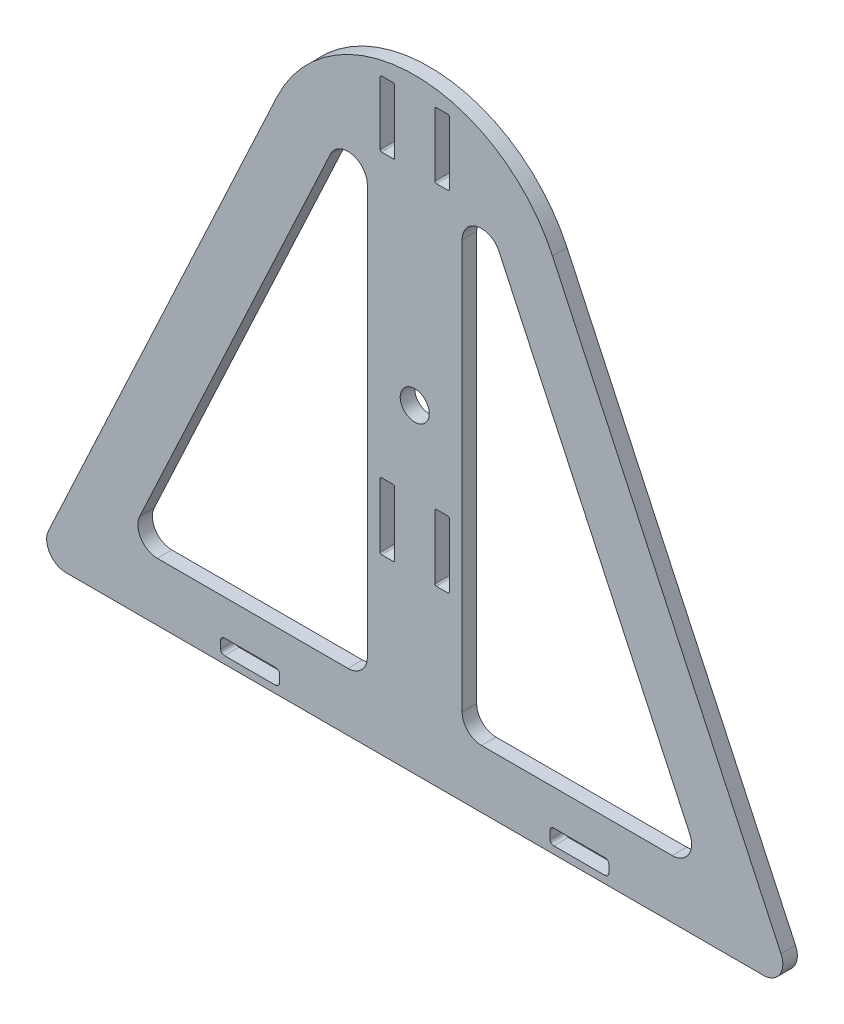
from build123d import *

# Parameters (mm, degrees)
EXTRUDE1_DEPTH     = 4.7625
SKETCH2_R          = 4.7625
CUT_EXTRUDE1_DEPTH = 231.102586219
CUT_EXTRUDE2_DEPTH = 231.102586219


with BuildPart() as part:
    # Sketch1 → Extrude1 (new body)
    with BuildSketch(Plane.XY):
        with BuildLine():
            Line((-120.055054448, 6.493625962), (-45.159285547, 167.108120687))
            ThreePointArc((-45.159285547, 167.108120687), (0, 195.877758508), (45.159285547, 167.108120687))
            Line((45.159285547, 167.108120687), (120.055054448, 6.493625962))
            ThreePointArc((120.055054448, 6.493625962), (119.655535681, 0.398147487), (114.3, -2.54))
            Line((114.3, -2.54), (30.236227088, -2.54))
            Line((30.236227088, -2.54), (-30.236227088, -2.54))
            Line((-30.236227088, -2.54), (-114.3, -2.54))
            ThreePointArc((-114.3, -2.54), (-119.655535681, 0.398147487), (-120.055054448, 6.493625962))
        make_face()
        with BuildLine():
            Line((-10.838206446, 190.1825), (-7.091706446, 190.1825))
            ThreePointArc((-7.091706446, 190.1825), (-6.732496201, 190.033710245), (-6.583706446, 189.6745))
            Line((-6.583706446, 189.6745), (-6.583706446, 169.1005))
            ThreePointArc((-6.583706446, 169.1005), (-6.732496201, 168.741289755), (-7.091706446, 168.5925))
            Line((-7.091706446, 168.5925), (-10.838206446, 168.5925))
            ThreePointArc((-10.838206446, 168.5925), (-11.19741669, 168.741289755), (-11.346206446, 169.1005))
            Line((-11.346206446, 169.1005), (-11.346206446, 189.6745))
            ThreePointArc((-11.346206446, 189.6745), (-11.19741669, 190.033710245), (-10.838206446, 190.1825))
        make_face(mode=Mode.SUBTRACT)
        with BuildLine():
            Line((6.583706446, 169.1005), (6.583706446, 189.6745))
            ThreePointArc((6.583706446, 189.6745), (6.732496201, 190.033710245), (7.091706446, 190.1825))
            Line((7.091706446, 190.1825), (10.838206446, 190.1825))
            ThreePointArc((10.838206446, 190.1825), (11.19741669, 190.033710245), (11.346206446, 189.6745))
            Line((11.346206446, 189.6745), (11.346206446, 169.1005))
            ThreePointArc((11.346206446, 169.1005), (11.19741669, 168.741289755), (10.838206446, 168.5925))
            Line((10.838206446, 168.5925), (7.091706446, 168.5925))
            ThreePointArc((7.091706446, 168.5925), (6.732496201, 168.741289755), (6.583706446, 169.1005))
        make_face(mode=Mode.SUBTRACT)
        with BuildLine():
            Line((7.091706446, 76.1365), (10.838206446, 76.1365))
            ThreePointArc((10.838206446, 76.1365), (11.19741669, 75.987710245), (11.346206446, 75.6285))
            Line((11.346206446, 75.6285), (11.346206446, 54.8005))
            ThreePointArc((11.346206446, 54.8005), (11.19741669, 54.441289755), (10.838206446, 54.2925))
            Line((10.838206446, 54.2925), (7.091706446, 54.2925))
            ThreePointArc((7.091706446, 54.2925), (6.732496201, 54.441289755), (6.583706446, 54.8005))
            Line((6.583706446, 54.8005), (6.583706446, 75.6285))
            ThreePointArc((6.583706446, 75.6285), (6.732496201, 75.987710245), (7.091706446, 76.1365))
        make_face(mode=Mode.SUBTRACT)
        with BuildLine():
            Line((63.627, 3.6195), (63.627, 1.143))
            ThreePointArc((63.627, 1.143), (63.255025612, 0.244974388), (62.357, -0.127))
            Line((62.357, -0.127), (45.593, -0.127))
            ThreePointArc((45.593, -0.127), (44.694974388, 0.244974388), (44.323, 1.143))
            Line((44.323, 1.143), (44.323, 3.6195))
            ThreePointArc((44.323, 3.6195), (44.694974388, 4.517525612), (45.593, 4.8895))
            Line((45.593, 4.8895), (62.357, 4.8895))
            ThreePointArc((62.357, 4.8895), (63.255025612, 4.517525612), (63.627, 3.6195))
        make_face(mode=Mode.SUBTRACT)
        with BuildLine():
            Line((-62.357, -0.127), (-45.593, -0.127))
            ThreePointArc((-45.593, -0.127), (-44.694974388, 0.244974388), (-44.323, 1.143))
            Line((-44.323, 1.143), (-44.323, 3.6195))
            ThreePointArc((-44.323, 3.6195), (-44.694974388, 4.517525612), (-45.593, 4.8895))
            Line((-45.593, 4.8895), (-62.357, 4.8895))
            ThreePointArc((-62.357, 4.8895), (-63.255025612, 4.517525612), (-63.627, 3.6195))
            Line((-63.627, 3.6195), (-63.627, 1.143))
            ThreePointArc((-63.627, 1.143), (-63.255025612, 0.244974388), (-62.357, -0.127))
        make_face(mode=Mode.SUBTRACT)
        with BuildLine():
            Line((-11.346206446, 75.6285), (-11.346206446, 54.8005))
            ThreePointArc((-11.346206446, 54.8005), (-11.19741669, 54.441289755), (-10.838206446, 54.2925))
            Line((-10.838206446, 54.2925), (-7.091706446, 54.2925))
            ThreePointArc((-7.091706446, 54.2925), (-6.732496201, 54.441289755), (-6.583706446, 54.8005))
            Line((-6.583706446, 54.8005), (-6.583706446, 75.6285))
            ThreePointArc((-6.583706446, 75.6285), (-6.732496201, 75.987710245), (-7.091706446, 76.1365))
            Line((-7.091706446, 76.1365), (-10.838206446, 76.1365))
            ThreePointArc((-10.838206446, 76.1365), (-11.19741669, 75.987710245), (-11.346206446, 75.6285))
        make_face(mode=Mode.SUBTRACT)
    extrude(amount=EXTRUDE1_DEPTH)

    # Sketch2 → Cut-Extrude1 (cut, through all)
    with BuildSketch(Plane.XY.offset(4.7625)):
        with Locations((0, 102.108)):
            Circle(SKETCH2_R)
    extrude(amount=-CUT_EXTRUDE1_DEPTH, mode=Mode.SUBTRACT)

    # Sketch3 → Cut-Extrude2 (cut, through all)
    with BuildSketch(Plane.XY.offset(4.7625)):
        with BuildLine():
            Line((84.397489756, 16.51), (21.887206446, 16.51))
            ThreePointArc((21.887206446, 16.51), (17.397078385, 18.369871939), (15.537206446, 22.86))
            Line((15.537206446, 22.86), (15.537206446, 156.913735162))
            ThreePointArc((15.537206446, 156.913735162), (20.512814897, 163.113214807), (27.642260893, 159.597361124))
            Line((27.642260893, 159.597361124), (90.152544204, 25.543625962))
            ThreePointArc((90.152544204, 25.543625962), (89.753025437, 19.448147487), (84.397489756, 16.51))
        make_face()
        with BuildLine():
            Line((-27.642260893, 159.597361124), (-90.152544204, 25.543625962))
            ThreePointArc((-90.152544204, 25.543625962), (-89.753025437, 19.448147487), (-84.397489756, 16.51))
            Line((-84.397489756, 16.51), (-21.887206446, 16.51))
            ThreePointArc((-21.887206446, 16.51), (-17.397078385, 18.369871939), (-15.537206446, 22.86))
            Line((-15.537206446, 22.86), (-15.537206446, 156.913735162))
            ThreePointArc((-15.537206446, 156.913735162), (-20.512814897, 163.113214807), (-27.642260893, 159.597361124))
        make_face()
    extrude(amount=-CUT_EXTRUDE2_DEPTH, mode=Mode.SUBTRACT)


solid = part.part
